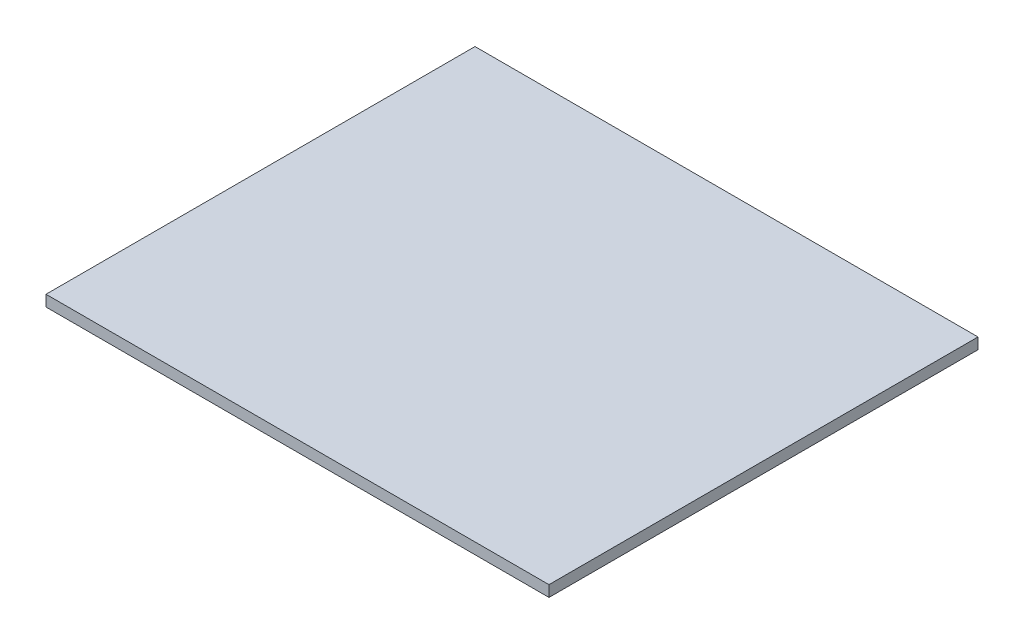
ISO-10303-21;
HEADER;
FILE_DESCRIPTION(('STEP AP214'),'2;1');
FILE_NAME('part.step','',(''),(''),'','','');
FILE_SCHEMA(('AUTOMOTIVE_DESIGN { 1 0 10303 214 1 1 1 1 }'));
ENDSEC;
DATA;
#1=APPLICATION_CONTEXT('core data for automotive mechanical design processes');
#2=APPLICATION_PROTOCOL_DEFINITION('international standard','automotive_design',2000,#1);
#3=PRODUCT_CONTEXT('',#1,'mechanical');
#4=PRODUCT('Part','Part','',(#3));
#5=PRODUCT_RELATED_PRODUCT_CATEGORY('part','',(#4));
#6=PRODUCT_DEFINITION_FORMATION('','',#4);
#7=PRODUCT_DEFINITION_CONTEXT('part definition',#1,'design');
#8=PRODUCT_DEFINITION('design','',#6,#7);
#9=PRODUCT_DEFINITION_SHAPE('','',#8);
#10=(LENGTH_UNIT() NAMED_UNIT(*) SI_UNIT(.MILLI.,.METRE.));
#11=(NAMED_UNIT(*) PLANE_ANGLE_UNIT() SI_UNIT($,.RADIAN.));
#12=(NAMED_UNIT(*) SI_UNIT($,.STERADIAN.) SOLID_ANGLE_UNIT());
#13=UNCERTAINTY_MEASURE_WITH_UNIT(LENGTH_MEASURE(1.E-05),#10,'distance_accuracy_value','');
#14=(GEOMETRIC_REPRESENTATION_CONTEXT(3) GLOBAL_UNCERTAINTY_ASSIGNED_CONTEXT((#13)) GLOBAL_UNIT_ASSIGNED_CONTEXT((#10,
#11,#12)) REPRESENTATION_CONTEXT('',''));
#15=CARTESIAN_POINT('',(0.,0.,0.));
#16=DIRECTION('',(0.,0.,1.));
#17=DIRECTION('',(1.,0.,0.));
#18=AXIS2_PLACEMENT_3D('',#15,#16,#17);
#19=CARTESIAN_POINT('',(107.95,4.7625,92.075));
#20=DIRECTION('',(-1.,0.,0.));
#21=DIRECTION('',(0.,0.,1.));
#22=AXIS2_PLACEMENT_3D('',#19,#20,#21);
#23=PLANE('',#22);
#24=DIRECTION('',(0.,0.,-1.));
#25=VECTOR('',#24,1.);
#26=CARTESIAN_POINT('',(107.95,0.,92.075));
#27=LINE('',#26,#25);
#28=CARTESIAN_POINT('',(107.95,0.,92.075));
#29=VERTEX_POINT('',#28);
#30=CARTESIAN_POINT('',(107.95,0.,-92.075));
#31=VERTEX_POINT('',#30);
#32=EDGE_CURVE('E105',#29,#31,#27,.T.);
#33=ORIENTED_EDGE('',*,*,#32,.T.);
#34=DIRECTION('',(0.,-1.,0.));
#35=VECTOR('',#34,1.);
#36=CARTESIAN_POINT('',(107.95,4.7625,-92.075));
#37=LINE('',#36,#35);
#38=CARTESIAN_POINT('',(107.95,4.7625,-92.075));
#39=VERTEX_POINT('',#38);
#40=EDGE_CURVE('E11',#39,#31,#37,.T.);
#41=ORIENTED_EDGE('',*,*,#40,.F.);
#42=DIRECTION('',(0.,0.,-1.));
#43=VECTOR('',#42,1.);
#44=CARTESIAN_POINT('',(107.95,4.7625,92.075));
#45=LINE('',#44,#43);
#46=CARTESIAN_POINT('',(107.95,4.7625,92.075));
#47=VERTEX_POINT('',#46);
#48=EDGE_CURVE('E93',#47,#39,#45,.T.);
#49=ORIENTED_EDGE('',*,*,#48,.F.);
#50=DIRECTION('',(0.,-1.,0.));
#51=VECTOR('',#50,1.);
#52=CARTESIAN_POINT('',(107.95,4.7625,92.075));
#53=LINE('',#52,#51);
#54=EDGE_CURVE('E101',#47,#29,#53,.T.);
#55=ORIENTED_EDGE('',*,*,#54,.T.);
#56=EDGE_LOOP('',(#33,#41,#49,#55));
#57=FACE_BOUND('',#56,.T.);
#58=ADVANCED_FACE('F42',(#57),#23,.F.);
#59=CARTESIAN_POINT('',(-107.95,4.7625,-92.075));
#60=DIRECTION('',(0.,0.,1.));
#61=DIRECTION('',(1.,0.,0.));
#62=AXIS2_PLACEMENT_3D('',#59,#60,#61);
#63=PLANE('',#62);
#64=DIRECTION('',(-1.,0.,0.));
#65=VECTOR('',#64,1.);
#66=CARTESIAN_POINT('',(-107.95,0.,-92.075));
#67=LINE('',#66,#65);
#68=CARTESIAN_POINT('',(-107.95,0.,-92.075));
#69=VERTEX_POINT('',#68);
#70=EDGE_CURVE('E97',#31,#69,#67,.T.);
#71=ORIENTED_EDGE('',*,*,#70,.T.);
#72=DIRECTION('',(0.,-1.,0.));
#73=VECTOR('',#72,1.);
#74=CARTESIAN_POINT('',(-107.95,4.7625,-92.075));
#75=LINE('',#74,#73);
#76=CARTESIAN_POINT('',(-107.95,4.7625,-92.075));
#77=VERTEX_POINT('',#76);
#78=EDGE_CURVE('E50',#77,#69,#75,.T.);
#79=ORIENTED_EDGE('',*,*,#78,.F.);
#80=DIRECTION('',(-1.,0.,0.));
#81=VECTOR('',#80,1.);
#82=CARTESIAN_POINT('',(-107.95,4.7625,-92.075));
#83=LINE('',#82,#81);
#84=EDGE_CURVE('E88',#39,#77,#83,.T.);
#85=ORIENTED_EDGE('',*,*,#84,.F.);
#86=ORIENTED_EDGE('',*,*,#40,.T.);
#87=EDGE_LOOP('',(#71,#79,#85,#86));
#88=FACE_BOUND('',#87,.T.);
#89=ADVANCED_FACE('F96',(#88),#63,.F.);
#90=CARTESIAN_POINT('',(-107.95,4.7625,92.075));
#91=DIRECTION('',(1.,0.,0.));
#92=DIRECTION('',(0.,0.,-1.));
#93=AXIS2_PLACEMENT_3D('',#90,#91,#92);
#94=PLANE('',#93);
#95=DIRECTION('',(0.,0.,1.));
#96=VECTOR('',#95,1.);
#97=CARTESIAN_POINT('',(-107.95,0.,92.075));
#98=LINE('',#97,#96);
#99=CARTESIAN_POINT('',(-107.95,0.,92.075));
#100=VERTEX_POINT('',#99);
#101=EDGE_CURVE('E75',#69,#100,#98,.T.);
#102=ORIENTED_EDGE('',*,*,#101,.T.);
#103=DIRECTION('',(0.,-1.,0.));
#104=VECTOR('',#103,1.);
#105=CARTESIAN_POINT('',(-107.95,4.7625,92.075));
#106=LINE('',#105,#104);
#107=CARTESIAN_POINT('',(-107.95,4.7625,92.075));
#108=VERTEX_POINT('',#107);
#109=EDGE_CURVE('E98',#108,#100,#106,.T.);
#110=ORIENTED_EDGE('',*,*,#109,.F.);
#111=DIRECTION('',(0.,0.,1.));
#112=VECTOR('',#111,1.);
#113=CARTESIAN_POINT('',(-107.95,4.7625,92.075));
#114=LINE('',#113,#112);
#115=EDGE_CURVE('E91',#77,#108,#114,.T.);
#116=ORIENTED_EDGE('',*,*,#115,.F.);
#117=ORIENTED_EDGE('',*,*,#78,.T.);
#118=EDGE_LOOP('',(#102,#110,#116,#117));
#119=FACE_BOUND('',#118,.T.);
#120=ADVANCED_FACE('F99',(#119),#94,.F.);
#121=CARTESIAN_POINT('',(-107.95,4.7625,92.075));
#122=DIRECTION('',(0.,0.,-1.));
#123=DIRECTION('',(-1.,0.,0.));
#124=AXIS2_PLACEMENT_3D('',#121,#122,#123);
#125=PLANE('',#124);
#126=DIRECTION('',(1.,0.,0.));
#127=VECTOR('',#126,1.);
#128=CARTESIAN_POINT('',(-107.95,0.,92.075));
#129=LINE('',#128,#127);
#130=EDGE_CURVE('E81',#100,#29,#129,.T.);
#131=ORIENTED_EDGE('',*,*,#130,.T.);
#132=ORIENTED_EDGE('',*,*,#54,.F.);
#133=DIRECTION('',(1.,0.,0.));
#134=VECTOR('',#133,1.);
#135=CARTESIAN_POINT('',(-107.95,4.7625,92.075));
#136=LINE('',#135,#134);
#137=EDGE_CURVE('E58',#108,#47,#136,.T.);
#138=ORIENTED_EDGE('',*,*,#137,.F.);
#139=ORIENTED_EDGE('',*,*,#109,.T.);
#140=EDGE_LOOP('',(#131,#132,#138,#139));
#141=FACE_BOUND('',#140,.T.);
#142=ADVANCED_FACE('F112',(#141),#125,.F.);
#143=CARTESIAN_POINT('',(0.,4.7625,0.));
#144=DIRECTION('',(0.,-1.,0.));
#145=DIRECTION('',(0.,0.,-1.));
#146=AXIS2_PLACEMENT_3D('',#143,#144,#145);
#147=PLANE('',#146);
#148=ORIENTED_EDGE('',*,*,#48,.T.);
#149=ORIENTED_EDGE('',*,*,#84,.T.);
#150=ORIENTED_EDGE('',*,*,#115,.T.);
#151=ORIENTED_EDGE('',*,*,#137,.T.);
#152=EDGE_LOOP('',(#148,#149,#150,#151));
#153=FACE_BOUND('',#152,.T.);
#154=ADVANCED_FACE('F89',(#153),#147,.F.);
#155=CARTESIAN_POINT('',(0.,0.,0.));
#156=DIRECTION('',(0.,-1.,0.));
#157=DIRECTION('',(0.,0.,-1.));
#158=AXIS2_PLACEMENT_3D('',#155,#156,#157);
#159=PLANE('',#158);
#160=ORIENTED_EDGE('',*,*,#32,.F.);
#161=ORIENTED_EDGE('',*,*,#130,.F.);
#162=ORIENTED_EDGE('',*,*,#101,.F.);
#163=ORIENTED_EDGE('',*,*,#70,.F.);
#164=EDGE_LOOP('',(#160,#161,#162,#163));
#165=FACE_BOUND('',#164,.T.);
#166=ADVANCED_FACE('F115',(#165),#159,.T.);
#167=CLOSED_SHELL('',(#58,#89,#120,#142,#154,#166));
#168=MANIFOLD_SOLID_BREP('B2',#167);
#169=ADVANCED_BREP_SHAPE_REPRESENTATION('',(#18,#168),#14);
#170=SHAPE_DEFINITION_REPRESENTATION(#9,#169);
ENDSEC;
END-ISO-10303-21;
